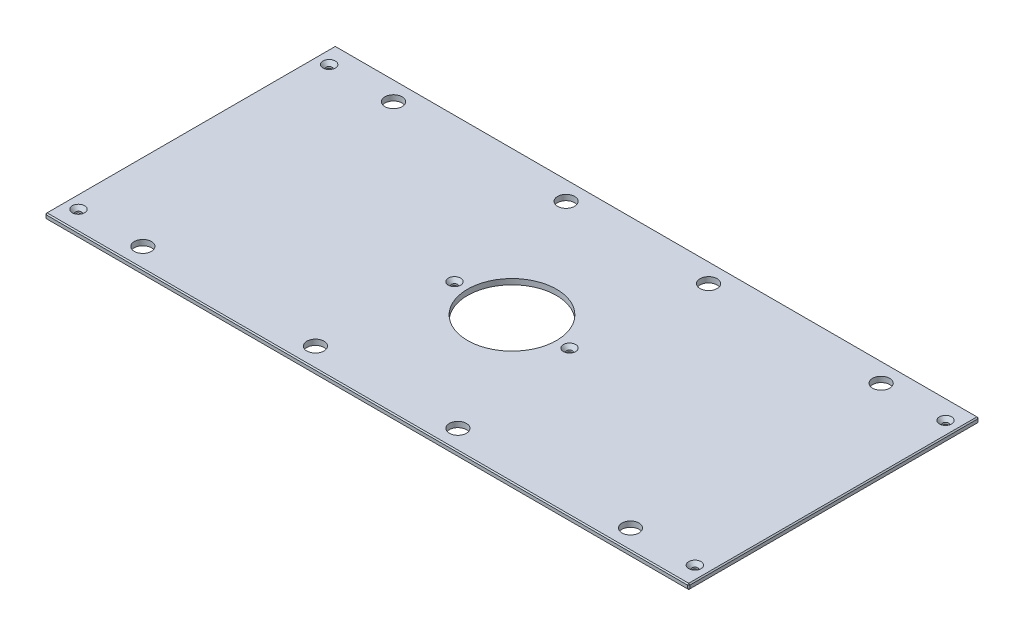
from build123d import *

# Parameters (mm, degrees)
SKETCH1_W                                     = 746.125
SKETCH1_H                                     = 336.55
BOSS_EXTRUDE1_DEPTH                           = 6.35
SKETCH13_R                                    = 51.562
CUT_EXTRUDE6_DEPTH                            = 410.3072526
F_25_32_0_78125_DIAMETER_HOLE1_D              = 19.84375
CHAMFER2_SIZE                                 = 1.27
CSK_FOR_1_4_FLAT_HEAD_MACHINE_SCREW1_AT_COUNT = 2
CSK_FOR_1_4_FLAT_HEAD_MACHINE_SCREW1_AT_PITCH = 290.50996
CSK_FOR_1_4_FLAT_HEAD_MACHINE_SCREW1_2_COUNT  = 2
CSK_FOR_1_4_FLAT_HEAD_MACHINE_SCREW1_2_PITCH  = 771.185890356
CSK_FOR_1_4_FLAT_HEAD_MACHINE_SCREW1_3_COUNT  = 2
CSK_FOR_1_4_FLAT_HEAD_MACHINE_SCREW1_3_PITCH  = 448.060741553
CSK_FOR_1_4_FLAT_HEAD_MACHINE_SCREW1_4_COUNT  = 2
CSK_FOR_1_4_FLAT_HEAD_MACHINE_SCREW1_4_PITCH  = 324.802281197
CSK_FOR_1_4_FLAT_HEAD_MACHINE_SCREW1_5_COUNT  = 2
CSK_FOR_1_4_FLAT_HEAD_MACHINE_SCREW1_5_PITCH  = 714.375
CSK_FOR_1_4_FLAT_HEAD_MACHINE_SCREW1_6_COUNT  = 2
CSK_FOR_1_4_FLAT_HEAD_MACHINE_SCREW1_6_PITCH  = 639.7625
CSK_FOR_1_4_FLAT_HEAD_MACHINE_SCREW1_7_COUNT  = 2
CSK_FOR_1_4_FLAT_HEAD_MACHINE_SCREW1_7_PITCH  = 702.632260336


with BuildPart() as part:
    # Sketch1 → Boss-Extrude1 (new body)
    with BuildSketch(Plane(origin=(0, 0, 0), x_dir=(1, 0, 0), z_dir=(0, 1, 0))):
        Rectangle(SKETCH1_W, SKETCH1_H)
    extrude(amount=BOSS_EXTRUDE1_DEPTH)

    # Sketch13 → Cut-Extrude6 (cut, through all)
    with BuildSketch(Plane(origin=(0, 6.35, 0), x_dir=(1, 0, 0), z_dir=(0, 1, 0))):
        with Locations(Location((0, 0, 0), (0, 0, 270))):
            Circle(SKETCH13_R)
    extrude(amount=-CUT_EXTRUDE6_DEPTH, mode=Mode.SUBTRACT)

    # 25_32 _0.78125_ Diameter Hole1 (through all)
    with Locations(Plane(origin=(0, 6.35, 0), x_dir=(1, 0, 0), z_dir=(0, 1, 0))):
        with Locations((282.575, 145.25498), (-282.575, 145.25498), (282.575, -145.25498), (-282.575, -145.25498), (-82.55, 145.25498), (82.55, 145.25498), (82.55, -145.25498), (-82.55, -145.25498)):
            Hole(F_25_32_0_78125_DIAMETER_HOLE1_D / 2)

    # Chamfer2
    chamfer2_edges = [part.edges().sort_by_distance(p)[0] for p in [
        (373.0625, 6.35, 0),
        (0, 6.35, -168.275),
        (-373.0625, 6.35, 0),
        (0, 0, -168.275),
        (373.0625, 0, 0),
        (0, 0, 168.275),
        (-373.0625, 0, 0),
        (0, 6.35, 168.275),
        (-373.0625, 3.175, -168.275),
        (373.0625, 3.175, -168.275),
        (373.0625, 3.175, 168.275),
        (-373.0625, 3.175, 168.275),
    ]]
    chamfer(chamfer2_edges, length=CHAMFER2_SIZE)

    # Sketch24 → CSK for 1_4 Flat Head Machine Screw1 (revolve, cut)
    with BuildSketch(Plane(origin=(357.1875, 6.35, -145.25498), x_dir=(0, 0, 1), z_dir=(1, 0, 0))):
        Polygon((0, 0), (0, 6.35), (3.3782, 6.35), (3.3782, 4.324464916), (7.1374, 0), align=None)
    csk_for_1_4_flat_head_machine_screw1 = revolve(axis=Axis((357.1875, 12.7, -145.25498), (0, -1, 0)), mode=Mode.SUBTRACT)

    # CSK for 1_4 Flat Head Machine Screw1 at: CSK for 1_4 Flat Head Machine Screw1 ×2
    with Locations(*[(0, 0, i * CSK_FOR_1_4_FLAT_HEAD_MACHINE_SCREW1_AT_PITCH) for i in range(1, CSK_FOR_1_4_FLAT_HEAD_MACHINE_SCREW1_AT_COUNT)]):
        add(csk_for_1_4_flat_head_machine_screw1, mode=Mode.SUBTRACT)

    # CSK for 1_4 Flat Head Machine Screw1 2: CSK for 1_4 Flat Head Machine Screw1 ×2
    with Locations(*[Vector(-0.9263330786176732, 0, 0.37670549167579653) * (i * CSK_FOR_1_4_FLAT_HEAD_MACHINE_SCREW1_2_PITCH) for i in range(1, CSK_FOR_1_4_FLAT_HEAD_MACHINE_SCREW1_2_COUNT)]):
        add(csk_for_1_4_flat_head_machine_screw1, mode=Mode.SUBTRACT)

    # CSK for 1_4 Flat Head Machine Screw1 3: CSK for 1_4 Flat Head Machine Screw1 ×2
    with Locations(*[Vector(-0.9459933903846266, 0, 0.3241859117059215) * (i * CSK_FOR_1_4_FLAT_HEAD_MACHINE_SCREW1_3_PITCH) for i in range(1, CSK_FOR_1_4_FLAT_HEAD_MACHINE_SCREW1_3_COUNT)]):
        add(csk_for_1_4_flat_head_machine_screw1, mode=Mode.SUBTRACT)

    # CSK for 1_4 Flat Head Machine Screw1 4: CSK for 1_4 Flat Head Machine Screw1 ×2
    with Locations(*[Vector(-0.8944287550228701, 0, 0.44721046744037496) * (i * CSK_FOR_1_4_FLAT_HEAD_MACHINE_SCREW1_4_PITCH) for i in range(1, CSK_FOR_1_4_FLAT_HEAD_MACHINE_SCREW1_4_COUNT)]):
        add(csk_for_1_4_flat_head_machine_screw1, mode=Mode.SUBTRACT)

    # CSK for 1_4 Flat Head Machine Screw1 5: CSK for 1_4 Flat Head Machine Screw1 ×2
    with Locations(*[(-i * CSK_FOR_1_4_FLAT_HEAD_MACHINE_SCREW1_5_PITCH, 0, 0) for i in range(1, CSK_FOR_1_4_FLAT_HEAD_MACHINE_SCREW1_5_COUNT)]):
        add(csk_for_1_4_flat_head_machine_screw1, mode=Mode.SUBTRACT)

    # CSK for 1_4 Flat Head Machine Screw1 6: CSK for 1_4 Flat Head Machine Screw1 ×2
    with Locations(*[(-i * CSK_FOR_1_4_FLAT_HEAD_MACHINE_SCREW1_6_PITCH, 0, 0) for i in range(1, CSK_FOR_1_4_FLAT_HEAD_MACHINE_SCREW1_6_COUNT)]):
        add(csk_for_1_4_flat_head_machine_screw1, mode=Mode.SUBTRACT)

    # CSK for 1_4 Flat Head Machine Screw1 7: CSK for 1_4 Flat Head Machine Screw1 ×2
    with Locations(*[Vector(-0.910522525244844, 0, 0.41345946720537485) * (i * CSK_FOR_1_4_FLAT_HEAD_MACHINE_SCREW1_7_PITCH) for i in range(1, CSK_FOR_1_4_FLAT_HEAD_MACHINE_SCREW1_7_COUNT)]):
        add(csk_for_1_4_flat_head_machine_screw1, mode=Mode.SUBTRACT)


solid = part.part
